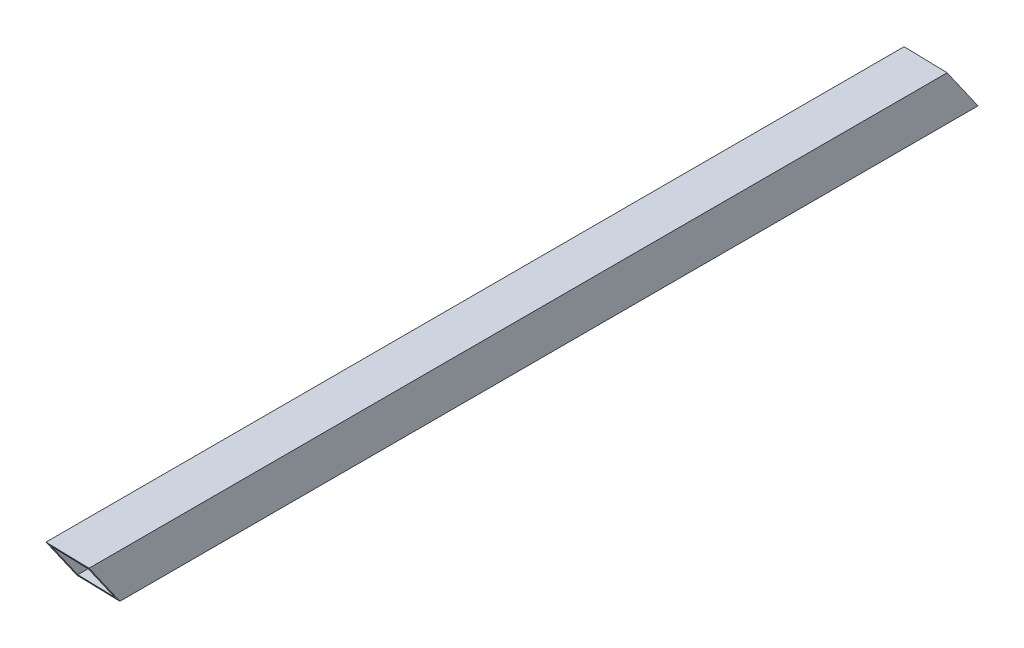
ISO-10303-21;
HEADER;
FILE_DESCRIPTION(('STEP AP214'),'2;1');
FILE_NAME('part.step','',(''),(''),'','','');
FILE_SCHEMA(('AUTOMOTIVE_DESIGN { 1 0 10303 214 1 1 1 1 }'));
ENDSEC;
DATA;
#1=APPLICATION_CONTEXT('core data for automotive mechanical design processes');
#2=APPLICATION_PROTOCOL_DEFINITION('international standard','automotive_design',2000,#1);
#3=PRODUCT_CONTEXT('',#1,'mechanical');
#4=PRODUCT('Part','Part','',(#3));
#5=PRODUCT_RELATED_PRODUCT_CATEGORY('part','',(#4));
#6=PRODUCT_DEFINITION_FORMATION('','',#4);
#7=PRODUCT_DEFINITION_CONTEXT('part definition',#1,'design');
#8=PRODUCT_DEFINITION('design','',#6,#7);
#9=PRODUCT_DEFINITION_SHAPE('','',#8);
#10=(LENGTH_UNIT() NAMED_UNIT(*) SI_UNIT(.MILLI.,.METRE.));
#11=(NAMED_UNIT(*) PLANE_ANGLE_UNIT() SI_UNIT($,.RADIAN.));
#12=(NAMED_UNIT(*) SI_UNIT($,.STERADIAN.) SOLID_ANGLE_UNIT());
#13=UNCERTAINTY_MEASURE_WITH_UNIT(LENGTH_MEASURE(1.E-05),#10,'distance_accuracy_value','');
#14=(GEOMETRIC_REPRESENTATION_CONTEXT(3) GLOBAL_UNCERTAINTY_ASSIGNED_CONTEXT((#13)) GLOBAL_UNIT_ASSIGNED_CONTEXT((#10,
#11,#12)) REPRESENTATION_CONTEXT('',''));
#15=CARTESIAN_POINT('',(0.,0.,0.));
#16=DIRECTION('',(0.,0.,1.));
#17=DIRECTION('',(1.,0.,0.));
#18=AXIS2_PLACEMENT_3D('',#15,#16,#17);
#19=CARTESIAN_POINT('',(-17.,17.,-20.));
#20=DIRECTION('',(1.,0.,0.));
#21=DIRECTION('',(0.,1.,0.));
#22=AXIS2_PLACEMENT_3D('',#19,#20,#21);
#23=PLANE('',#22);
#24=DIRECTION('',(0.,-0.819285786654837,-0.573385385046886));
#25=VECTOR('',#24,1.);
#26=CARTESIAN_POINT('',(-17.,1.202734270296,0.426750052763));
#27=LINE('',#26,#25);
#28=CARTESIAN_POINT('',(-17.,17.,11.482625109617));
#29=VERTEX_POINT('',#28);
#30=CARTESIAN_POINT('',(-17.,-17.,-12.3126163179));
#31=VERTEX_POINT('',#30);
#32=EDGE_CURVE('E169',#29,#31,#27,.T.);
#33=ORIENTED_EDGE('',*,*,#32,.F.);
#34=DIRECTION('',(0.,0.,1.));
#35=VECTOR('',#34,1.);
#36=CARTESIAN_POINT('',(-17.,17.,-20.));
#37=LINE('',#36,#35);
#38=CARTESIAN_POINT('',(-17.,17.,789.75499067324));
#39=VERTEX_POINT('',#38);
#40=EDGE_CURVE('E10',#29,#39,#37,.T.);
#41=ORIENTED_EDGE('',*,*,#40,.T.);
#42=DIRECTION('',(0.,0.819285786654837,0.573385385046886));
#43=VECTOR('',#42,1.);
#44=CARTESIAN_POINT('',(-17.,-364.4035480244,522.82588753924));
#45=LINE('',#44,#43);
#46=CARTESIAN_POINT('',(-17.,-17.,765.95974924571));
#47=VERTEX_POINT('',#46);
#48=EDGE_CURVE('E183',#47,#39,#45,.T.);
#49=ORIENTED_EDGE('',*,*,#48,.F.);
#50=DIRECTION('',(0.,0.,1.));
#51=VECTOR('',#50,1.);
#52=CARTESIAN_POINT('',(-17.,-17.,-20.));
#53=LINE('',#52,#51);
#54=EDGE_CURVE('E73',#31,#47,#53,.T.);
#55=ORIENTED_EDGE('',*,*,#54,.F.);
#56=EDGE_LOOP('',(#33,#41,#49,#55));
#57=FACE_BOUND('',#56,.T.);
#58=ADVANCED_FACE('F16',(#57),#23,.T.);
#59=CARTESIAN_POINT('',(17.,17.,-20.));
#60=DIRECTION('',(0.,-1.,0.));
#61=DIRECTION('',(0.,0.,-1.));
#62=AXIS2_PLACEMENT_3D('',#59,#60,#61);
#63=PLANE('',#62);
#64=DIRECTION('',(-0.999702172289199,0.,-0.0244042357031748));
#65=VECTOR('',#64,1.);
#66=CARTESIAN_POINT('',(7.96070214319,17.,12.091953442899));
#67=LINE('',#66,#65);
#68=CARTESIAN_POINT('',(17.,17.,12.312616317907));
#69=VERTEX_POINT('',#68);
#70=EDGE_CURVE('E158',#69,#29,#67,.T.);
#71=ORIENTED_EDGE('',*,*,#70,.F.);
#72=DIRECTION('',(0.,0.,1.));
#73=VECTOR('',#72,1.);
#74=CARTESIAN_POINT('',(17.,17.,-20.));
#75=LINE('',#74,#73);
#76=CARTESIAN_POINT('',(17.,17.,790.58498188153));
#77=VERTEX_POINT('',#76);
#78=EDGE_CURVE('E26',#69,#77,#75,.T.);
#79=ORIENTED_EDGE('',*,*,#78,.T.);
#80=DIRECTION('',(0.999702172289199,0.,0.0244042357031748));
#81=VECTOR('',#80,1.);
#82=CARTESIAN_POINT('',(-11.02678342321,17.,789.9008058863));
#83=LINE('',#82,#81);
#84=EDGE_CURVE('E187',#39,#77,#83,.T.);
#85=ORIENTED_EDGE('',*,*,#84,.F.);
#86=ORIENTED_EDGE('',*,*,#40,.F.);
#87=EDGE_LOOP('',(#71,#79,#85,#86));
#88=FACE_BOUND('',#87,.T.);
#89=ADVANCED_FACE('F207',(#88),#63,.T.);
#90=CARTESIAN_POINT('',(17.,-17.,-20.));
#91=DIRECTION('',(-1.,0.,0.));
#92=DIRECTION('',(0.,0.,1.));
#93=AXIS2_PLACEMENT_3D('',#90,#91,#92);
#94=PLANE('',#93);
#95=DIRECTION('',(0.,0.819285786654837,0.573385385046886));
#96=VECTOR('',#95,1.);
#97=CARTESIAN_POINT('',(17.,-10.59806419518,-7.002166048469));
#98=LINE('',#97,#96);
#99=CARTESIAN_POINT('',(17.,-17.,-11.48262510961));
#100=VERTEX_POINT('',#99);
#101=EDGE_CURVE('E155',#100,#69,#98,.T.);
#102=ORIENTED_EDGE('',*,*,#101,.F.);
#103=DIRECTION('',(0.,0.,1.));
#104=VECTOR('',#103,1.);
#105=CARTESIAN_POINT('',(17.,-17.,-20.));
#106=LINE('',#105,#104);
#107=CARTESIAN_POINT('',(17.,-17.,766.789740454));
#108=VERTEX_POINT('',#107);
#109=EDGE_CURVE('E39',#100,#108,#106,.T.);
#110=ORIENTED_EDGE('',*,*,#109,.T.);
#111=DIRECTION('',(0.,-0.819285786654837,-0.573385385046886));
#112=VECTOR('',#111,1.);
#113=CARTESIAN_POINT('',(17.,-376.2043464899,515.39697143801));
#114=LINE('',#113,#112);
#115=EDGE_CURVE('E191',#77,#108,#114,.T.);
#116=ORIENTED_EDGE('',*,*,#115,.F.);
#117=ORIENTED_EDGE('',*,*,#78,.F.);
#118=EDGE_LOOP('',(#102,#110,#116,#117));
#119=FACE_BOUND('',#118,.T.);
#120=ADVANCED_FACE('F18',(#119),#94,.T.);
#121=CARTESIAN_POINT('',(-17.,-17.,-20.));
#122=DIRECTION('',(0.,1.,0.));
#123=DIRECTION('',(1.,0.,0.));
#124=AXIS2_PLACEMENT_3D('',#121,#122,#123);
#125=PLANE('',#124);
#126=DIRECTION('',(0.999702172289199,0.,0.0244042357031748));
#127=VECTOR('',#126,1.);
#128=CARTESIAN_POINT('',(-8.4486414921,-17.,-12.1038647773));
#129=LINE('',#128,#127);
#130=EDGE_CURVE('E173',#31,#100,#129,.T.);
#131=ORIENTED_EDGE('',*,*,#130,.F.);
#132=ORIENTED_EDGE('',*,*,#54,.T.);
#133=DIRECTION('',(-0.999702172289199,0.,-0.0244042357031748));
#134=VECTOR('',#133,1.);
#135=CARTESIAN_POINT('',(-27.4361270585,-17.,765.70498766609));
#136=LINE('',#135,#134);
#137=EDGE_CURVE('E195',#108,#47,#136,.T.);
#138=ORIENTED_EDGE('',*,*,#137,.F.);
#139=ORIENTED_EDGE('',*,*,#109,.F.);
#140=EDGE_LOOP('',(#131,#132,#138,#139));
#141=FACE_BOUND('',#140,.T.);
#142=ADVANCED_FACE('F213',(#141),#125,.T.);
#143=CARTESIAN_POINT('',(20.,20.,-20.));
#144=DIRECTION('',(0.,-1.,0.));
#145=DIRECTION('',(0.,0.,-1.));
#146=AXIS2_PLACEMENT_3D('',#143,#144,#145);
#147=PLANE('',#146);
#148=DIRECTION('',(0.,0.,1.));
#149=VECTOR('',#148,1.);
#150=CARTESIAN_POINT('',(-20.,20.,-20.));
#151=LINE('',#150,#149);
#152=CARTESIAN_POINT('',(-20.,20.,13.508970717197));
#153=VERTEX_POINT('',#152);
#154=CARTESIAN_POINT('',(-20.,20.,791.78133628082));
#155=VERTEX_POINT('',#154);
#156=EDGE_CURVE('E94',#153,#155,#151,.T.);
#157=ORIENTED_EDGE('',*,*,#156,.T.);
#158=DIRECTION('',(0.999702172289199,0.,0.0244042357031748));
#159=VECTOR('',#158,1.);
#160=CARTESIAN_POINT('',(-9.578900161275,20.,792.03573102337));
#161=LINE('',#160,#159);
#162=CARTESIAN_POINT('',(20.,20.,792.75779652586));
#163=VERTEX_POINT('',#162);
#164=EDGE_CURVE('E58',#155,#163,#161,.T.);
#165=ORIENTED_EDGE('',*,*,#164,.T.);
#166=DIRECTION('',(0.,0.,1.));
#167=VECTOR('',#166,1.);
#168=CARTESIAN_POINT('',(20.,20.,-20.));
#169=LINE('',#168,#167);
#170=CARTESIAN_POINT('',(20.,20.,14.485430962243));
#171=VERTEX_POINT('',#170);
#172=EDGE_CURVE('E176',#171,#163,#169,.T.);
#173=ORIENTED_EDGE('',*,*,#172,.F.);
#174=DIRECTION('',(-0.999702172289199,0.,-0.0244042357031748));
#175=VECTOR('',#174,1.);
#176=CARTESIAN_POINT('',(9.408585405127,20.,14.226878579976));
#177=LINE('',#176,#175);
#178=EDGE_CURVE('E124',#171,#153,#177,.T.);
#179=ORIENTED_EDGE('',*,*,#178,.T.);
#180=EDGE_LOOP('',(#157,#165,#173,#179));
#181=FACE_BOUND('',#180,.T.);
#182=ADVANCED_FACE('F235',(#181),#147,.F.);
#183=CARTESIAN_POINT('',(-20.,20.,-20.));
#184=DIRECTION('',(1.,0.,0.));
#185=DIRECTION('',(0.,1.,0.));
#186=AXIS2_PLACEMENT_3D('',#183,#184,#185);
#187=PLANE('',#186);
#188=DIRECTION('',(0.,0.,1.));
#189=VECTOR('',#188,1.);
#190=CARTESIAN_POINT('',(-20.,-20.,-20.));
#191=LINE('',#190,#189);
#192=CARTESIAN_POINT('',(-20.,-20.,-14.48543096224));
#193=VERTEX_POINT('',#192);
#194=CARTESIAN_POINT('',(-20.,-20.,763.78693460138));
#195=VERTEX_POINT('',#194);
#196=EDGE_CURVE('E137',#193,#195,#191,.T.);
#197=ORIENTED_EDGE('',*,*,#196,.T.);
#198=DIRECTION('',(0.,0.819285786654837,0.573385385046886));
#199=VECTOR('',#198,1.);
#200=CARTESIAN_POINT('',(-20.,-363.362301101,523.48138013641));
#201=LINE('',#200,#199);
#202=EDGE_CURVE('E154',#195,#155,#201,.T.);
#203=ORIENTED_EDGE('',*,*,#202,.T.);
#204=ORIENTED_EDGE('',*,*,#156,.F.);
#205=DIRECTION('',(0.,-0.819285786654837,-0.573385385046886));
#206=VECTOR('',#205,1.);
#207=CARTESIAN_POINT('',(-20.,2.243981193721,1.08224264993));
#208=LINE('',#207,#206);
#209=EDGE_CURVE('E129',#153,#193,#208,.T.);
#210=ORIENTED_EDGE('',*,*,#209,.T.);
#211=EDGE_LOOP('',(#197,#203,#204,#210));
#212=FACE_BOUND('',#211,.T.);
#213=ADVANCED_FACE('F234',(#212),#187,.F.);
#214=CARTESIAN_POINT('',(-12.74745076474,-365.4600982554,522.19026138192));
#215=DIRECTION('',(0.0199960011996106,0.573270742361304,-0.819121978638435));
#216=DIRECTION('',(-0.999702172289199,0.,-0.0244042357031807));
#217=AXIS2_PLACEMENT_3D('',#214,#215,#216);
#218=PLANE('',#217);
#219=ORIENTED_EDGE('',*,*,#48,.T.);
#220=ORIENTED_EDGE('',*,*,#84,.T.);
#221=ORIENTED_EDGE('',*,*,#115,.T.);
#222=ORIENTED_EDGE('',*,*,#137,.T.);
#223=EDGE_LOOP('',(#219,#220,#221,#222));
#224=FACE_BOUND('',#223,.T.);
#225=ORIENTED_EDGE('',*,*,#164,.F.);
#226=ORIENTED_EDGE('',*,*,#202,.F.);
#227=DIRECTION('',(-0.999702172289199,0.,-0.0244042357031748));
#228=VECTOR('',#227,1.);
#229=CARTESIAN_POINT('',(-28.88401032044,-20.,763.57006252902));
#230=LINE('',#229,#228);
#231=CARTESIAN_POINT('',(20.,-20.,764.76339484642));
#232=VERTEX_POINT('',#231);
#233=EDGE_CURVE('E144',#232,#195,#230,.T.);
#234=ORIENTED_EDGE('',*,*,#233,.F.);
#235=DIRECTION('',(0.,-0.819285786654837,-0.573385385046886));
#236=VECTOR('',#235,1.);
#237=CARTESIAN_POINT('',(20.,-377.2455934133,514.74147884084));
#238=LINE('',#237,#236);
#239=EDGE_CURVE('E141',#163,#232,#238,.T.);
#240=ORIENTED_EDGE('',*,*,#239,.F.);
#241=EDGE_LOOP('',(#225,#226,#234,#240));
#242=FACE_BOUND('',#241,.T.);
#243=ADVANCED_FACE('F209',(#224,#242),#218,.F.);
#244=CARTESIAN_POINT('',(20.,-20.,-20.));
#245=DIRECTION('',(-1.,0.,0.));
#246=DIRECTION('',(0.,0.,1.));
#247=AXIS2_PLACEMENT_3D('',#244,#245,#246);
#248=PLANE('',#247);
#249=ORIENTED_EDGE('',*,*,#172,.T.);
#250=ORIENTED_EDGE('',*,*,#239,.T.);
#251=DIRECTION('',(0.,0.,1.));
#252=VECTOR('',#251,1.);
#253=CARTESIAN_POINT('',(20.,-20.,-20.));
#254=LINE('',#253,#252);
#255=CARTESIAN_POINT('',(20.,-20.,-13.50897071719));
#256=VERTEX_POINT('',#255);
#257=EDGE_CURVE('E135',#256,#232,#254,.T.);
#258=ORIENTED_EDGE('',*,*,#257,.F.);
#259=DIRECTION('',(0.,0.819285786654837,0.573385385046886));
#260=VECTOR('',#259,1.);
#261=CARTESIAN_POINT('',(20.,-11.63931111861,-7.657658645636));
#262=LINE('',#261,#260);
#263=EDGE_CURVE('E118',#256,#171,#262,.T.);
#264=ORIENTED_EDGE('',*,*,#263,.T.);
#265=EDGE_LOOP('',(#249,#250,#258,#264));
#266=FACE_BOUND('',#265,.T.);
#267=ADVANCED_FACE('F140',(#266),#248,.F.);
#268=CARTESIAN_POINT('',(0.,0.,0.));
#269=DIRECTION('',(-0.0199960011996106,-0.573270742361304,0.819121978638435));
#270=DIRECTION('',(-0.999392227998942,0.0348593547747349,0.));
#271=AXIS2_PLACEMENT_3D('',#268,#269,#270);
#272=PLANE('',#271);
#273=ORIENTED_EDGE('',*,*,#101,.T.);
#274=ORIENTED_EDGE('',*,*,#70,.T.);
#275=ORIENTED_EDGE('',*,*,#32,.T.);
#276=ORIENTED_EDGE('',*,*,#130,.T.);
#277=EDGE_LOOP('',(#273,#274,#275,#276));
#278=FACE_BOUND('',#277,.T.);
#279=ORIENTED_EDGE('',*,*,#178,.F.);
#280=ORIENTED_EDGE('',*,*,#263,.F.);
#281=DIRECTION('',(0.999702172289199,0.,0.0244042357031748));
#282=VECTOR('',#281,1.);
#283=CARTESIAN_POINT('',(-9.896524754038,-20.,-14.23878991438));
#284=LINE('',#283,#282);
#285=EDGE_CURVE('E121',#193,#256,#284,.T.);
#286=ORIENTED_EDGE('',*,*,#285,.F.);
#287=ORIENTED_EDGE('',*,*,#209,.F.);
#288=EDGE_LOOP('',(#279,#280,#286,#287));
#289=FACE_BOUND('',#288,.T.);
#290=ADVANCED_FACE('F120',(#278,#289),#272,.F.);
#291=CARTESIAN_POINT('',(-20.,-20.,-20.));
#292=DIRECTION('',(0.,1.,0.));
#293=DIRECTION('',(1.,0.,0.));
#294=AXIS2_PLACEMENT_3D('',#291,#292,#293);
#295=PLANE('',#294);
#296=ORIENTED_EDGE('',*,*,#257,.T.);
#297=ORIENTED_EDGE('',*,*,#233,.T.);
#298=ORIENTED_EDGE('',*,*,#196,.F.);
#299=ORIENTED_EDGE('',*,*,#285,.T.);
#300=EDGE_LOOP('',(#296,#297,#298,#299));
#301=FACE_BOUND('',#300,.T.);
#302=ADVANCED_FACE('F133',(#301),#295,.F.);
#303=CLOSED_SHELL('',(#58,#89,#120,#142,#182,#213,#243,#267,#290,#302));
#304=MANIFOLD_SOLID_BREP('B1',#303);
#305=ADVANCED_BREP_SHAPE_REPRESENTATION('',(#18,#304),#14);
#306=SHAPE_DEFINITION_REPRESENTATION(#9,#305);
ENDSEC;
END-ISO-10303-21;
